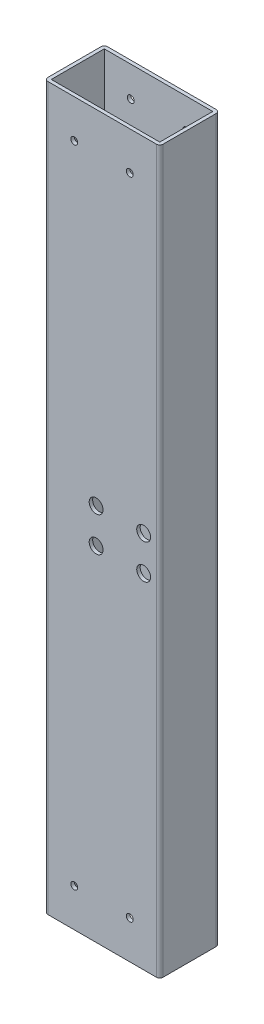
from build123d import *

# Parameters (mm, degrees)
SKETCH1_W           = 49.657
SKETCH1_H           = 24.257
EXTRUDE_THIN1_DEPTH = 165.1
SKETCH2_R           = 1.5875
CUT_EXTRUDE1_DEPTH  = 168.761568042
SKETCH3_R           = 1.5875
CUT_EXTRUDE2_DEPTH  = 168.761568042
SKETCH4_R           = 3.175
CUT_EXTRUDE3_DEPTH  = 170.435325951


with BuildPart() as part:
    # Sketch1 → Extrude-Thin1 (new, symmetric)
    with BuildSketch(Plane(origin=(0, 0, 0), x_dir=(1, 0, 0), z_dir=(0, 1, 0))):
        with BuildLine():
            Line((-26.416, 12.1285), (-26.416, -12.1285))
            ThreePointArc((-26.416, -12.1285), (-25.951032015, -13.251032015), (-24.8285, -13.716))
            Line((-24.8285, -13.716), (24.8285, -13.716))
            ThreePointArc((24.8285, -13.716), (25.951032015, -13.251032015), (26.416, -12.1285))
            Line((26.416, -12.1285), (26.416, 12.1285))
            ThreePointArc((26.416, 12.1285), (25.951032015, 13.251032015), (24.8285, 13.716))
            Line((24.8285, 13.716), (-24.8285, 13.716))
            ThreePointArc((-24.8285, 13.716), (-25.951032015, 13.251032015), (-26.416, 12.1285))
        make_face()
        Rectangle(SKETCH1_W, SKETCH1_H, mode=Mode.SUBTRACT)
    extrude(amount=EXTRUDE_THIN1_DEPTH, both=True)

    # Sketch2 → Cut-Extrude1 (cut, through all)
    with BuildSketch(Plane.XY):
        with Locations((-12.7, 151.257)):
            Circle(SKETCH2_R)
        with Locations((12.7, 151.257)):
            Circle(SKETCH2_R)
        with Locations((12.7, -151.257)):
            Circle(SKETCH2_R)
        with Locations((-12.7, -151.257)):
            Circle(SKETCH2_R)
    extrude(amount=-CUT_EXTRUDE1_DEPTH, mode=Mode.SUBTRACT)

    # Sketch3 → Cut-Extrude2 (cut, through all)
    with BuildSketch(Plane.XY):
        with Locations(Location((12.7, -147.6375, 0), (0, 0, 180))):
            Circle(SKETCH3_R)
        with Locations(Location((-12.7, -147.6375, 0), (0, 0, 180))):
            Circle(SKETCH3_R)
        with Locations(Location((-12.7, 147.6375, 0), (0, 0, 180))):
            Circle(SKETCH3_R)
        with Locations(Location((12.7, 147.6375, 0), (0, 0, 180))):
            Circle(SKETCH3_R)
    extrude(amount=CUT_EXTRUDE2_DEPTH, mode=Mode.SUBTRACT)

    # Sketch4 → Cut-Extrude3 (cut, through all)
    with BuildSketch(Plane(origin=(0, 0, -13.716), x_dir=(-1, 0, 0), z_dir=(0, 0, -1))):
        with Locations((-19.05, 7.9375)):
            Circle(SKETCH4_R)
        with Locations((-19.05, -7.9375)):
            Circle(SKETCH4_R)
        with Locations((2.7, -7.9375)):
            Circle(SKETCH4_R)
        with Locations((2.7, 7.9375)):
            Circle(SKETCH4_R)
    extrude(amount=-CUT_EXTRUDE3_DEPTH, mode=Mode.SUBTRACT)


solid = part.part
